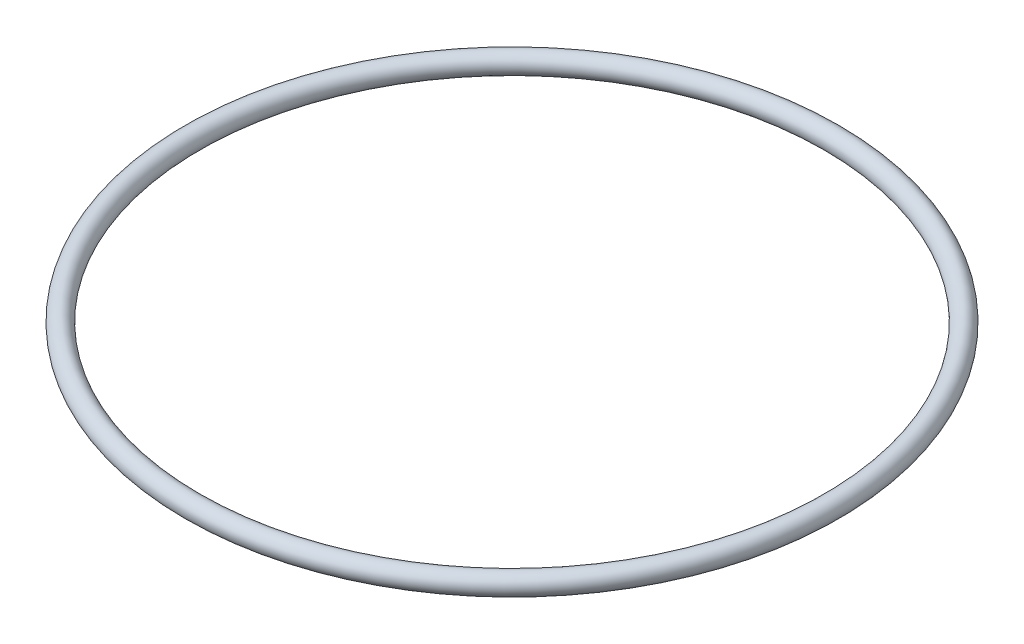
from build123d import *

# Parameters (mm, degrees)
SKETCH1_R = 1.7653


with BuildPart() as part:
    # Sketch1 → Revolve1 (revolve)
    with BuildSketch(Plane.XY, mode=Mode.PRIVATE) as revolve1_sk:
        with Locations((-55.5371, 0)):
            Circle(SKETCH1_R)
    revolve(revolve1_sk.sketch.rotate(Axis((0, 0, 0), (0, 1, 0)), 270), axis=Axis((0, 0, 0), (0, 1, 0)))


solid = part.part
